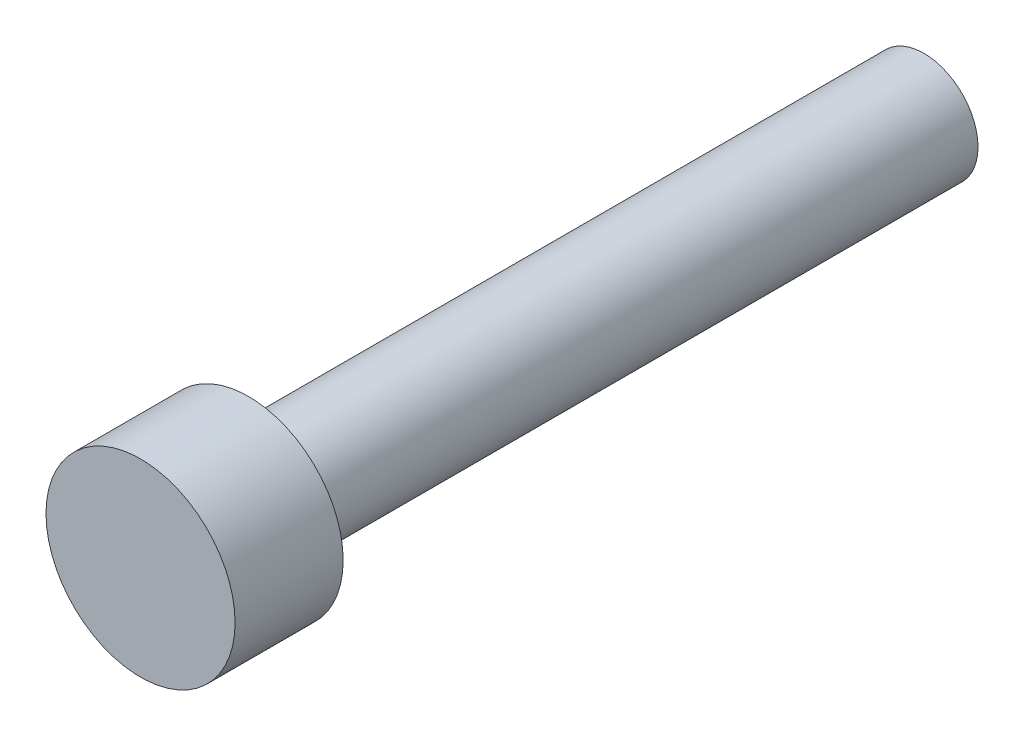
ISO-10303-21;
HEADER;
FILE_DESCRIPTION(('STEP AP214'),'2;1');
FILE_NAME('part.step','',(''),(''),'','','');
FILE_SCHEMA(('AUTOMOTIVE_DESIGN { 1 0 10303 214 1 1 1 1 }'));
ENDSEC;
DATA;
#1=APPLICATION_CONTEXT('core data for automotive mechanical design processes');
#2=APPLICATION_PROTOCOL_DEFINITION('international standard','automotive_design',2000,#1);
#3=PRODUCT_CONTEXT('',#1,'mechanical');
#4=PRODUCT('Part','Part','',(#3));
#5=PRODUCT_RELATED_PRODUCT_CATEGORY('part','',(#4));
#6=PRODUCT_DEFINITION_FORMATION('','',#4);
#7=PRODUCT_DEFINITION_CONTEXT('part definition',#1,'design');
#8=PRODUCT_DEFINITION('design','',#6,#7);
#9=PRODUCT_DEFINITION_SHAPE('','',#8);
#10=(LENGTH_UNIT() NAMED_UNIT(*) SI_UNIT(.MILLI.,.METRE.));
#11=(NAMED_UNIT(*) PLANE_ANGLE_UNIT() SI_UNIT($,.RADIAN.));
#12=(NAMED_UNIT(*) SI_UNIT($,.STERADIAN.) SOLID_ANGLE_UNIT());
#13=UNCERTAINTY_MEASURE_WITH_UNIT(LENGTH_MEASURE(1.E-05),#10,'distance_accuracy_value','');
#14=(GEOMETRIC_REPRESENTATION_CONTEXT(3) GLOBAL_UNCERTAINTY_ASSIGNED_CONTEXT((#13)) GLOBAL_UNIT_ASSIGNED_CONTEXT((#10,
#11,#12)) REPRESENTATION_CONTEXT('',''));
#15=CARTESIAN_POINT('',(0.,0.,0.));
#16=DIRECTION('',(0.,0.,1.));
#17=DIRECTION('',(1.,0.,0.));
#18=AXIS2_PLACEMENT_3D('',#15,#16,#17);
#19=CARTESIAN_POINT('',(0.,0.,25.));
#20=DIRECTION('',(0.,0.,-1.));
#21=DIRECTION('',(-1.,0.,0.));
#22=AXIS2_PLACEMENT_3D('',#19,#20,#21);
#23=CYLINDRICAL_SURFACE('',#22,2.);
#24=CARTESIAN_POINT('',(0.,0.,25.));
#25=DIRECTION('',(0.,0.,1.));
#26=DIRECTION('',(1.,0.,0.));
#27=AXIS2_PLACEMENT_3D('',#24,#25,#26);
#28=CIRCLE('',#27,2.);
#29=CARTESIAN_POINT('',(2.,0.,25.));
#30=VERTEX_POINT('',#29);
#31=EDGE_CURVE('E10',#30,#30,#28,.T.);
#32=ORIENTED_EDGE('',*,*,#31,.F.);
#33=EDGE_LOOP('',(#32));
#34=FACE_BOUND('',#33,.T.);
#35=CARTESIAN_POINT('',(0.,0.,0.));
#36=DIRECTION('',(0.,0.,1.));
#37=DIRECTION('',(1.,0.,0.));
#38=AXIS2_PLACEMENT_3D('',#35,#36,#37);
#39=CIRCLE('',#38,2.);
#40=CARTESIAN_POINT('',(2.,0.,0.));
#41=VERTEX_POINT('',#40);
#42=EDGE_CURVE('E35',#41,#41,#39,.T.);
#43=ORIENTED_EDGE('',*,*,#42,.T.);
#44=EDGE_LOOP('',(#43));
#45=FACE_BOUND('',#44,.T.);
#46=ADVANCED_FACE('F32',(#34,#45),#23,.T.);
#47=CARTESIAN_POINT('',(0.,0.,0.));
#48=DIRECTION('',(0.,0.,1.));
#49=DIRECTION('',(1.,0.,0.));
#50=AXIS2_PLACEMENT_3D('',#47,#48,#49);
#51=PLANE('',#50);
#52=ORIENTED_EDGE('',*,*,#42,.F.);
#53=EDGE_LOOP('',(#52));
#54=FACE_BOUND('',#53,.T.);
#55=ADVANCED_FACE('F55',(#54),#51,.F.);
#56=CARTESIAN_POINT('',(0.,0.,29.));
#57=DIRECTION('',(0.,0.,-1.));
#58=DIRECTION('',(-1.,0.,0.));
#59=AXIS2_PLACEMENT_3D('',#56,#57,#58);
#60=CYLINDRICAL_SURFACE('',#59,3.5);
#61=CARTESIAN_POINT('',(0.,0.,29.));
#62=DIRECTION('',(0.,0.,1.));
#63=DIRECTION('',(1.,0.,0.));
#64=AXIS2_PLACEMENT_3D('',#61,#62,#63);
#65=CIRCLE('',#64,3.5);
#66=CARTESIAN_POINT('',(3.5,0.,29.));
#67=VERTEX_POINT('',#66);
#68=EDGE_CURVE('E42',#67,#67,#65,.T.);
#69=ORIENTED_EDGE('',*,*,#68,.F.);
#70=EDGE_LOOP('',(#69));
#71=FACE_BOUND('',#70,.T.);
#72=CARTESIAN_POINT('',(0.,0.,25.));
#73=DIRECTION('',(0.,0.,1.));
#74=DIRECTION('',(1.,0.,0.));
#75=AXIS2_PLACEMENT_3D('',#72,#73,#74);
#76=CIRCLE('',#75,3.5);
#77=CARTESIAN_POINT('',(3.5,0.,25.));
#78=VERTEX_POINT('',#77);
#79=EDGE_CURVE('E44',#78,#78,#76,.T.);
#80=ORIENTED_EDGE('',*,*,#79,.T.);
#81=EDGE_LOOP('',(#80));
#82=FACE_BOUND('',#81,.T.);
#83=ADVANCED_FACE('F52',(#71,#82),#60,.T.);
#84=CARTESIAN_POINT('',(0.,0.,29.));
#85=DIRECTION('',(0.,0.,1.));
#86=DIRECTION('',(1.,0.,0.));
#87=AXIS2_PLACEMENT_3D('',#84,#85,#86);
#88=PLANE('',#87);
#89=ORIENTED_EDGE('',*,*,#68,.T.);
#90=EDGE_LOOP('',(#89));
#91=FACE_BOUND('',#90,.T.);
#92=ADVANCED_FACE('F50',(#91),#88,.T.);
#93=CARTESIAN_POINT('',(0.,0.,25.));
#94=DIRECTION('',(0.,0.,1.));
#95=DIRECTION('',(1.,0.,0.));
#96=AXIS2_PLACEMENT_3D('',#93,#94,#95);
#97=PLANE('',#96);
#98=ORIENTED_EDGE('',*,*,#31,.T.);
#99=EDGE_LOOP('',(#98));
#100=FACE_BOUND('',#99,.T.);
#101=ORIENTED_EDGE('',*,*,#79,.F.);
#102=EDGE_LOOP('',(#101));
#103=FACE_BOUND('',#102,.T.);
#104=ADVANCED_FACE('F59',(#100,#103),#97,.F.);
#105=CLOSED_SHELL('',(#46,#55,#83,#92,#104));
#106=MANIFOLD_SOLID_BREP('B2',#105);
#107=ADVANCED_BREP_SHAPE_REPRESENTATION('',(#18,#106),#14);
#108=SHAPE_DEFINITION_REPRESENTATION(#9,#107);
ENDSEC;
END-ISO-10303-21;
